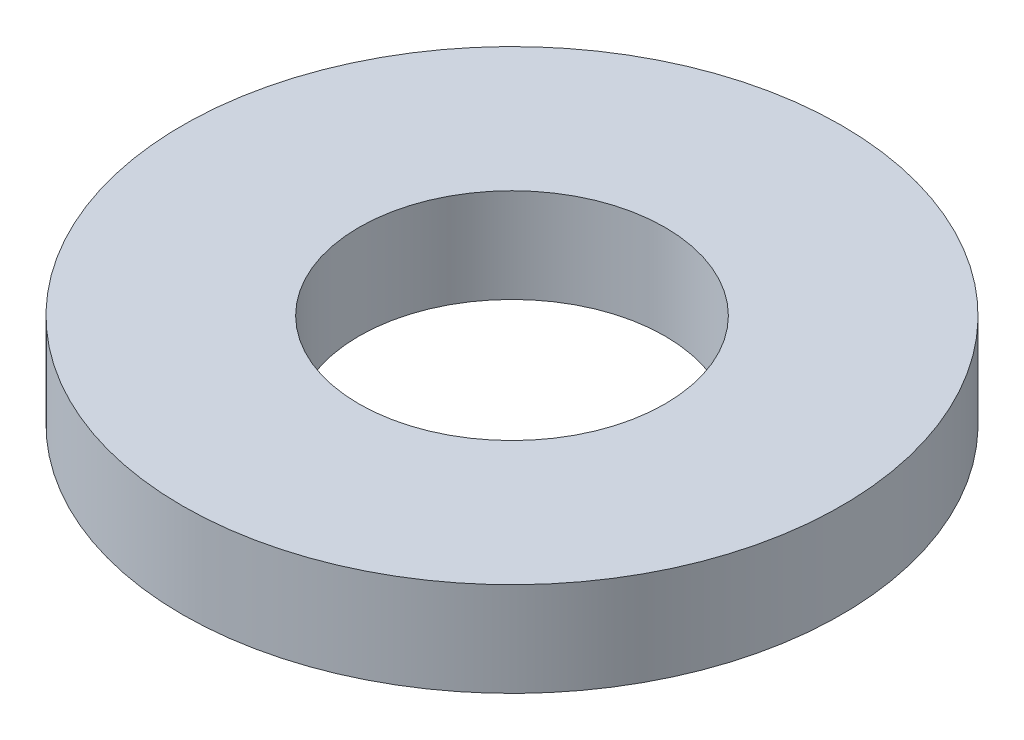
ISO-10303-21;
HEADER;
FILE_DESCRIPTION(('STEP AP214'),'2;1');
FILE_NAME('part.step','',(''),(''),'','','');
FILE_SCHEMA(('AUTOMOTIVE_DESIGN { 1 0 10303 214 1 1 1 1 }'));
ENDSEC;
DATA;
#1=APPLICATION_CONTEXT('core data for automotive mechanical design processes');
#2=APPLICATION_PROTOCOL_DEFINITION('international standard','automotive_design',2000,#1);
#3=PRODUCT_CONTEXT('',#1,'mechanical');
#4=PRODUCT('Part','Part','',(#3));
#5=PRODUCT_RELATED_PRODUCT_CATEGORY('part','',(#4));
#6=PRODUCT_DEFINITION_FORMATION('','',#4);
#7=PRODUCT_DEFINITION_CONTEXT('part definition',#1,'design');
#8=PRODUCT_DEFINITION('design','',#6,#7);
#9=PRODUCT_DEFINITION_SHAPE('','',#8);
#10=(LENGTH_UNIT() NAMED_UNIT(*) SI_UNIT(.MILLI.,.METRE.));
#11=(NAMED_UNIT(*) PLANE_ANGLE_UNIT() SI_UNIT($,.RADIAN.));
#12=(NAMED_UNIT(*) SI_UNIT($,.STERADIAN.) SOLID_ANGLE_UNIT());
#13=UNCERTAINTY_MEASURE_WITH_UNIT(LENGTH_MEASURE(1.E-05),#10,'distance_accuracy_value','');
#14=(GEOMETRIC_REPRESENTATION_CONTEXT(3) GLOBAL_UNCERTAINTY_ASSIGNED_CONTEXT((#13)) GLOBAL_UNIT_ASSIGNED_CONTEXT((#10,
#11,#12)) REPRESENTATION_CONTEXT('',''));
#15=CARTESIAN_POINT('',(0.,0.,0.));
#16=DIRECTION('',(0.,0.,1.));
#17=DIRECTION('',(1.,0.,0.));
#18=AXIS2_PLACEMENT_3D('',#15,#16,#17);
#19=CARTESIAN_POINT('',(0.,3.175,0.));
#20=DIRECTION('',(0.,1.,0.));
#21=DIRECTION('',(0.,0.,1.));
#22=AXIS2_PLACEMENT_3D('',#19,#20,#21);
#23=PLANE('',#22);
#24=CARTESIAN_POINT('',(0.,3.175,0.));
#25=DIRECTION('',(0.,1.,0.));
#26=DIRECTION('',(0.,0.,1.));
#27=AXIS2_PLACEMENT_3D('',#24,#25,#26);
#28=CIRCLE('',#27,11.1125);
#29=CARTESIAN_POINT('',(0.,3.175,11.1125));
#30=VERTEX_POINT('',#29);
#31=EDGE_CURVE('E10',#30,#30,#28,.T.);
#32=ORIENTED_EDGE('',*,*,#31,.T.);
#33=EDGE_LOOP('',(#32));
#34=FACE_BOUND('',#33,.T.);
#35=CARTESIAN_POINT('',(0.,3.175,0.));
#36=DIRECTION('',(0.,1.,0.));
#37=DIRECTION('',(0.,0.,1.));
#38=AXIS2_PLACEMENT_3D('',#35,#36,#37);
#39=CIRCLE('',#38,5.159375);
#40=CARTESIAN_POINT('',(0.,3.175,5.159375));
#41=VERTEX_POINT('',#40);
#42=EDGE_CURVE('E41',#41,#41,#39,.T.);
#43=ORIENTED_EDGE('',*,*,#42,.F.);
#44=EDGE_LOOP('',(#43));
#45=FACE_BOUND('',#44,.T.);
#46=ADVANCED_FACE('F30',(#34,#45),#23,.T.);
#47=CARTESIAN_POINT('',(0.,0.,0.));
#48=DIRECTION('',(0.,1.,0.));
#49=DIRECTION('',(0.,0.,1.));
#50=AXIS2_PLACEMENT_3D('',#47,#48,#49);
#51=PLANE('',#50);
#52=CARTESIAN_POINT('',(0.,0.,0.));
#53=DIRECTION('',(0.,1.,0.));
#54=DIRECTION('',(0.,0.,1.));
#55=AXIS2_PLACEMENT_3D('',#52,#53,#54);
#56=CIRCLE('',#55,11.1125);
#57=CARTESIAN_POINT('',(0.,0.,11.1125));
#58=VERTEX_POINT('',#57);
#59=EDGE_CURVE('E34',#58,#58,#56,.T.);
#60=ORIENTED_EDGE('',*,*,#59,.F.);
#61=EDGE_LOOP('',(#60));
#62=FACE_BOUND('',#61,.T.);
#63=CARTESIAN_POINT('',(0.,0.,0.));
#64=DIRECTION('',(0.,1.,0.));
#65=DIRECTION('',(0.,0.,1.));
#66=AXIS2_PLACEMENT_3D('',#63,#64,#65);
#67=CIRCLE('',#66,5.159375);
#68=CARTESIAN_POINT('',(0.,0.,5.159375));
#69=VERTEX_POINT('',#68);
#70=EDGE_CURVE('E43',#69,#69,#67,.T.);
#71=ORIENTED_EDGE('',*,*,#70,.T.);
#72=EDGE_LOOP('',(#71));
#73=FACE_BOUND('',#72,.T.);
#74=ADVANCED_FACE('F53',(#62,#73),#51,.F.);
#75=CARTESIAN_POINT('',(0.,3.175,0.));
#76=DIRECTION('',(0.,-1.,0.));
#77=DIRECTION('',(0.,0.,-1.));
#78=AXIS2_PLACEMENT_3D('',#75,#76,#77);
#79=CYLINDRICAL_SURFACE('',#78,11.1125);
#80=ORIENTED_EDGE('',*,*,#31,.F.);
#81=EDGE_LOOP('',(#80));
#82=FACE_BOUND('',#81,.T.);
#83=ORIENTED_EDGE('',*,*,#59,.T.);
#84=EDGE_LOOP('',(#83));
#85=FACE_BOUND('',#84,.T.);
#86=ADVANCED_FACE('F32',(#82,#85),#79,.T.);
#87=CARTESIAN_POINT('',(0.,3.175,0.));
#88=DIRECTION('',(0.,-1.,0.));
#89=DIRECTION('',(0.,0.,-1.));
#90=AXIS2_PLACEMENT_3D('',#87,#88,#89);
#91=CYLINDRICAL_SURFACE('',#90,5.159375);
#92=ORIENTED_EDGE('',*,*,#42,.T.);
#93=EDGE_LOOP('',(#92));
#94=FACE_BOUND('',#93,.T.);
#95=ORIENTED_EDGE('',*,*,#70,.F.);
#96=EDGE_LOOP('',(#95));
#97=FACE_BOUND('',#96,.T.);
#98=ADVANCED_FACE('F49',(#94,#97),#91,.F.);
#99=CLOSED_SHELL('',(#46,#74,#86,#98));
#100=MANIFOLD_SOLID_BREP('B2',#99);
#101=ADVANCED_BREP_SHAPE_REPRESENTATION('',(#18,#100),#14);
#102=SHAPE_DEFINITION_REPRESENTATION(#9,#101);
ENDSEC;
END-ISO-10303-21;
